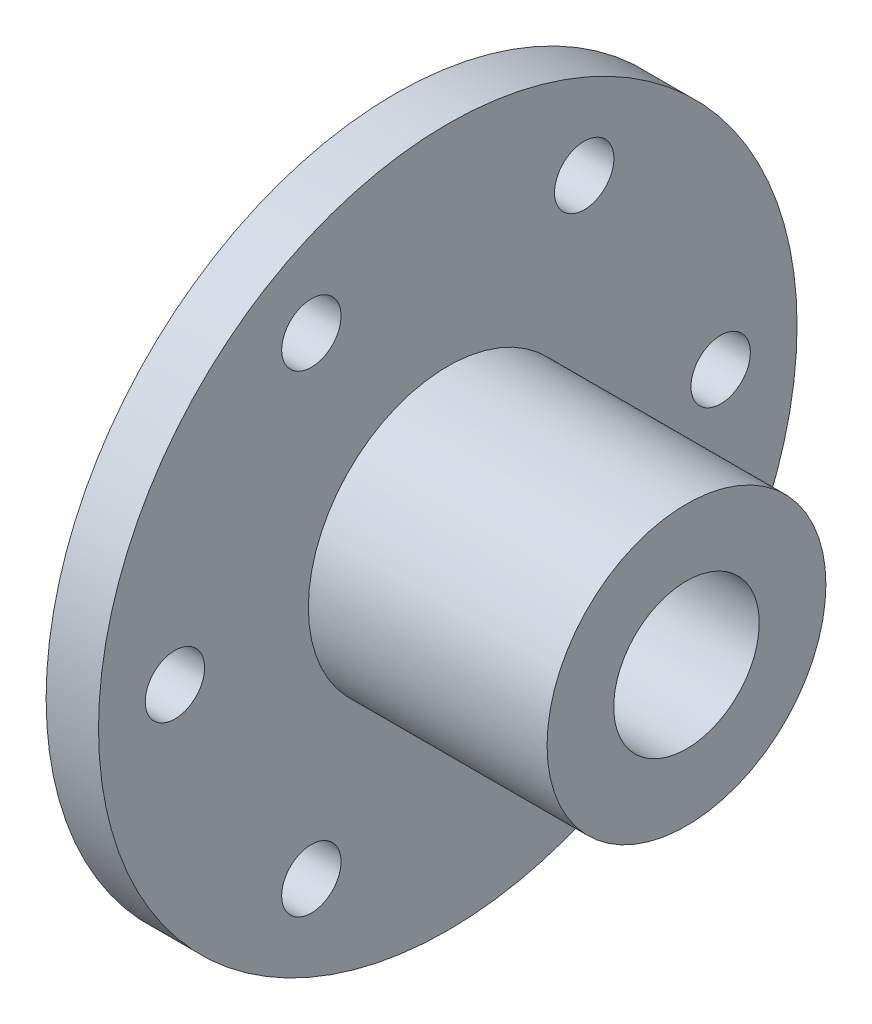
from build123d import *

# Parameters (mm, degrees)
SKETCH1_W           = 4.572
SKETCH1_H           = 30.48
SKETCH2_R           = 12.1666
BOSS_EXTRUDE1_DEPTH = 20.828
CUT_EXTRUDE1_DEPTH  = 51.032197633
HOLE1_D             = 5.1816
HOLE1_DEPTH         = 25.4
SKETCH6_R           = 6.35
CUT_EXTRUDE2_DEPTH  = 51.032197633


with BuildPart() as part:
    # Sketch1 → Revolve1 (revolve)
    with BuildSketch(Plane(origin=(0, 0, 0), x_dir=(-1, 0, 0), z_dir=(0, 0, -1)), mode=Mode.PRIVATE) as revolve1_sk:
        with Locations((15.321066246, 15.24)):
            Rectangle(SKETCH1_W, SKETCH1_H)
    revolve(revolve1_sk.sketch.rotate(Axis((-13.035066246, 0, 0), (-1, 0, 0)), 270), axis=Axis((-13.035066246, 0, 0), (-1, 0, 0)))

    # Sketch2 → Boss-Extrude1 (add)
    with BuildSketch(Plane(origin=(-13.035066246, 0, 0), x_dir=(0, 0, -1), z_dir=(1, 0, 0))):
        Circle(SKETCH2_R)
    extrude(amount=BOSS_EXTRUDE1_DEPTH)

    # Sketch3 → Cut-Extrude1 (cut, through all)
    with BuildSketch(Plane.ZY.offset(17.607066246)):
        Polygon((5.499261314, 0), (2.749630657, 4.7625), (-2.749630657, 4.7625), (-5.499261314, 0), (-2.749630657, -4.7625), (2.749630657, -4.7625), align=None)
    extrude(amount=-CUT_EXTRUDE1_DEPTH, mode=Mode.SUBTRACT)

    # Hole1
    with Locations(Plane.ZY.offset(17.607066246)):
        with Locations((23.8125, 0), (11.90625, -20.622229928), (-11.90625, -20.622229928), (-23.8125, 0), (-11.90625, 20.622229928), (11.90625, 20.622229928)):
            Hole(HOLE1_D / 2, depth=HOLE1_DEPTH)

    # Sketch6 → Cut-Extrude2 (cut, through all)
    with BuildSketch(Plane(origin=(7.792933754, 0, 0), x_dir=(0, 0, -1), z_dir=(1, 0, 0))):
        Circle(SKETCH6_R)
    extrude(amount=-CUT_EXTRUDE2_DEPTH, mode=Mode.SUBTRACT)


solid = part.part
